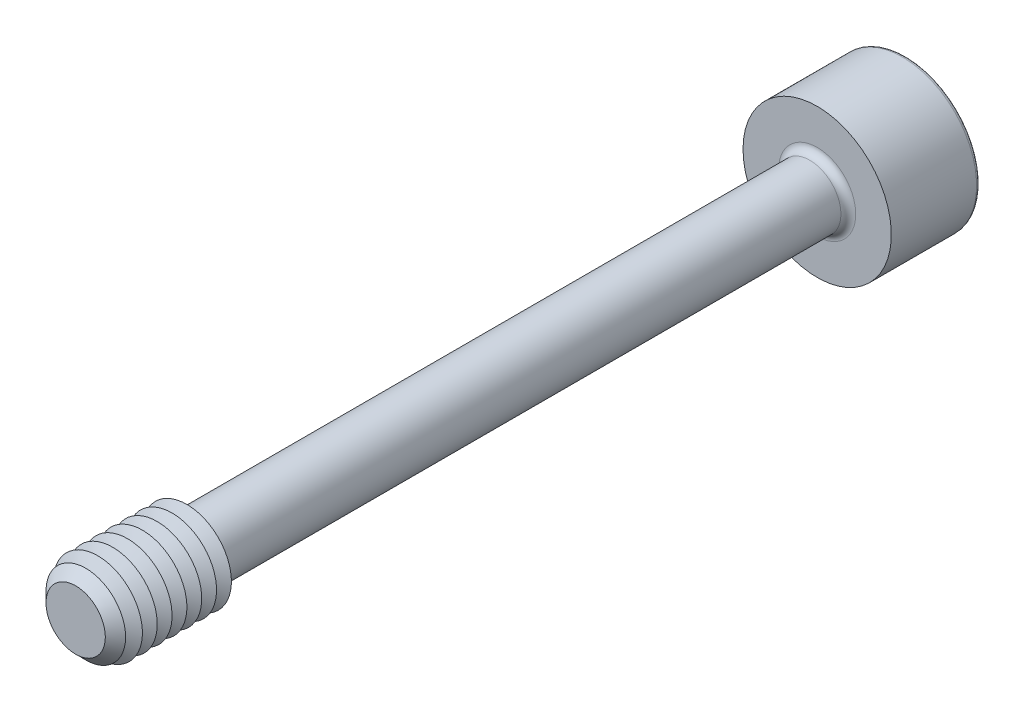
ISO-10303-21;
HEADER;
FILE_DESCRIPTION(('STEP AP214'),'2;1');
FILE_NAME('part.step','',(''),(''),'','','');
FILE_SCHEMA(('AUTOMOTIVE_DESIGN { 1 0 10303 214 1 1 1 1 }'));
ENDSEC;
DATA;
#1=APPLICATION_CONTEXT('core data for automotive mechanical design processes');
#2=APPLICATION_PROTOCOL_DEFINITION('international standard','automotive_design',2000,#1);
#3=PRODUCT_CONTEXT('',#1,'mechanical');
#4=PRODUCT('Part','Part','',(#3));
#5=PRODUCT_RELATED_PRODUCT_CATEGORY('part','',(#4));
#6=PRODUCT_DEFINITION_FORMATION('','',#4);
#7=PRODUCT_DEFINITION_CONTEXT('part definition',#1,'design');
#8=PRODUCT_DEFINITION('design','',#6,#7);
#9=PRODUCT_DEFINITION_SHAPE('','',#8);
#10=(LENGTH_UNIT() NAMED_UNIT(*) SI_UNIT(.MILLI.,.METRE.));
#11=(NAMED_UNIT(*) PLANE_ANGLE_UNIT() SI_UNIT($,.RADIAN.));
#12=(NAMED_UNIT(*) SI_UNIT($,.STERADIAN.) SOLID_ANGLE_UNIT());
#13=UNCERTAINTY_MEASURE_WITH_UNIT(LENGTH_MEASURE(1.E-05),#10,'distance_accuracy_value','');
#14=(GEOMETRIC_REPRESENTATION_CONTEXT(3) GLOBAL_UNCERTAINTY_ASSIGNED_CONTEXT((#13)) GLOBAL_UNIT_ASSIGNED_CONTEXT((#10,
#11,#12)) REPRESENTATION_CONTEXT('',''));
#15=CARTESIAN_POINT('',(0.,0.,0.));
#16=DIRECTION('',(0.,0.,1.));
#17=DIRECTION('',(1.,0.,0.));
#18=AXIS2_PLACEMENT_3D('',#15,#16,#17);
#19=CARTESIAN_POINT('',(-1.44337567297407,-2.5,-26.));
#20=DIRECTION('',(0.,0.,1.));
#21=DIRECTION('',(1.,0.,0.));
#22=AXIS2_PLACEMENT_3D('',#19,#20,#21);
#23=PLANE('',#22);
#24=DIRECTION('',(1.,0.,0.));
#25=VECTOR('',#24,1.);
#26=CARTESIAN_POINT('',(-1.44337567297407,-2.5,-26.));
#27=LINE('',#26,#25);
#28=CARTESIAN_POINT('',(0.,-2.5,-26.));
#29=VERTEX_POINT('',#28);
#30=CARTESIAN_POINT('',(1.44337567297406,-2.5,-26.));
#31=VERTEX_POINT('',#30);
#32=EDGE_CURVE('E728',#29,#31,#27,.T.);
#33=ORIENTED_EDGE('',*,*,#32,.F.);
#34=CARTESIAN_POINT('',(0.,0.,-26.));
#35=DIRECTION('',(0.,0.,1.));
#36=DIRECTION('',(0.,-1.,0.));
#37=AXIS2_PLACEMENT_3D('',#34,#35,#36);
#38=CIRCLE('',#37,2.5);
#39=CARTESIAN_POINT('',(2.1650635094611,-1.25,-26.));
#40=VERTEX_POINT('',#39);
#41=EDGE_CURVE('E53',#29,#40,#38,.T.);
#42=ORIENTED_EDGE('',*,*,#41,.T.);
#43=DIRECTION('',(0.5,0.866025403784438,0.));
#44=VECTOR('',#43,1.);
#45=CARTESIAN_POINT('',(1.44337567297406,-2.5,-26.));
#46=LINE('',#45,#44);
#47=EDGE_CURVE('E713',#31,#40,#46,.T.);
#48=ORIENTED_EDGE('',*,*,#47,.F.);
#49=EDGE_LOOP('',(#33,#42,#48));
#50=FACE_BOUND('',#49,.T.);
#51=ADVANCED_FACE('F41',(#50),#23,.F.);
#52=CARTESIAN_POINT('',(2.88675134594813,0.,-26.));
#53=VERTEX_POINT('',#52);
#54=EDGE_CURVE('E724',#40,#53,#46,.T.);
#55=ORIENTED_EDGE('',*,*,#54,.F.);
#56=CARTESIAN_POINT('',(2.1650635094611,1.25,-26.));
#57=VERTEX_POINT('',#56);
#58=EDGE_CURVE('E11',#40,#57,#38,.T.);
#59=ORIENTED_EDGE('',*,*,#58,.T.);
#60=DIRECTION('',(-0.5,0.866025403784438,0.));
#61=VECTOR('',#60,1.);
#62=CARTESIAN_POINT('',(2.88675134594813,0.,-26.));
#63=LINE('',#62,#61);
#64=EDGE_CURVE('E712',#53,#57,#63,.T.);
#65=ORIENTED_EDGE('',*,*,#64,.F.);
#66=EDGE_LOOP('',(#55,#59,#65));
#67=FACE_BOUND('',#66,.T.);
#68=ADVANCED_FACE('F133',(#67),#23,.F.);
#69=CARTESIAN_POINT('',(1.44337567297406,2.5,-26.));
#70=VERTEX_POINT('',#69);
#71=EDGE_CURVE('E707',#57,#70,#63,.T.);
#72=ORIENTED_EDGE('',*,*,#71,.F.);
#73=CARTESIAN_POINT('',(0.,2.5,-26.));
#74=VERTEX_POINT('',#73);
#75=EDGE_CURVE('E51',#57,#74,#38,.T.);
#76=ORIENTED_EDGE('',*,*,#75,.T.);
#77=DIRECTION('',(-1.,0.,0.));
#78=VECTOR('',#77,1.);
#79=CARTESIAN_POINT('',(1.44337567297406,2.5,-26.));
#80=LINE('',#79,#78);
#81=EDGE_CURVE('E177',#70,#74,#80,.T.);
#82=ORIENTED_EDGE('',*,*,#81,.F.);
#83=EDGE_LOOP('',(#72,#76,#82));
#84=FACE_BOUND('',#83,.T.);
#85=ADVANCED_FACE('F139',(#84),#23,.F.);
#86=CARTESIAN_POINT('',(-1.44337567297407,2.5,-26.));
#87=VERTEX_POINT('',#86);
#88=EDGE_CURVE('E718',#74,#87,#80,.T.);
#89=ORIENTED_EDGE('',*,*,#88,.F.);
#90=CARTESIAN_POINT('',(-2.1650635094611,1.25,-26.));
#91=VERTEX_POINT('',#90);
#92=EDGE_CURVE('E264',#74,#91,#38,.T.);
#93=ORIENTED_EDGE('',*,*,#92,.T.);
#94=DIRECTION('',(-0.5,-0.866025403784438,0.));
#95=VECTOR('',#94,1.);
#96=CARTESIAN_POINT('',(-1.44337567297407,2.5,-26.));
#97=LINE('',#96,#95);
#98=EDGE_CURVE('E176',#87,#91,#97,.T.);
#99=ORIENTED_EDGE('',*,*,#98,.F.);
#100=EDGE_LOOP('',(#89,#93,#99));
#101=FACE_BOUND('',#100,.T.);
#102=ADVANCED_FACE('F157',(#101),#23,.F.);
#103=CARTESIAN_POINT('',(-2.88675134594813,0.,-26.));
#104=VERTEX_POINT('',#103);
#105=EDGE_CURVE('E170',#91,#104,#97,.T.);
#106=ORIENTED_EDGE('',*,*,#105,.F.);
#107=CARTESIAN_POINT('',(-2.1650635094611,-1.25,-26.));
#108=VERTEX_POINT('',#107);
#109=EDGE_CURVE('E172',#91,#108,#38,.T.);
#110=ORIENTED_EDGE('',*,*,#109,.T.);
#111=DIRECTION('',(0.5,-0.866025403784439,0.));
#112=VECTOR('',#111,1.);
#113=CARTESIAN_POINT('',(-2.88675134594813,0.,-26.));
#114=LINE('',#113,#112);
#115=EDGE_CURVE('E174',#104,#108,#114,.T.);
#116=ORIENTED_EDGE('',*,*,#115,.F.);
#117=EDGE_LOOP('',(#106,#110,#116));
#118=FACE_BOUND('',#117,.T.);
#119=ADVANCED_FACE('F146',(#118),#23,.F.);
#120=CARTESIAN_POINT('',(0.,0.,-31.));
#121=DIRECTION('',(0.,0.,-1.));
#122=DIRECTION('',(-1.,0.,0.));
#123=AXIS2_PLACEMENT_3D('',#120,#121,#122);
#124=PLANE('',#123);
#125=CARTESIAN_POINT('',(0.,0.,-31.));
#126=DIRECTION('',(0.,0.,-1.));
#127=DIRECTION('',(-1.,0.,0.));
#128=AXIS2_PLACEMENT_3D('',#125,#126,#127);
#129=CIRCLE('',#128,4.75);
#130=CARTESIAN_POINT('',(-4.75,0.,-31.));
#131=VERTEX_POINT('',#130);
#132=EDGE_CURVE('E250',#131,#131,#129,.T.);
#133=ORIENTED_EDGE('',*,*,#132,.T.);
#134=EDGE_LOOP('',(#133));
#135=FACE_BOUND('',#134,.T.);
#136=DIRECTION('',(-0.5,-0.866025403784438,0.));
#137=VECTOR('',#136,1.);
#138=CARTESIAN_POINT('',(-1.44337567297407,2.5,-31.));
#139=LINE('',#138,#137);
#140=CARTESIAN_POINT('',(-1.44337567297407,2.5,-31.));
#141=VERTEX_POINT('',#140);
#142=CARTESIAN_POINT('',(-2.88675134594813,0.,-31.));
#143=VERTEX_POINT('',#142);
#144=EDGE_CURVE('E212',#141,#143,#139,.T.);
#145=ORIENTED_EDGE('',*,*,#144,.T.);
#146=DIRECTION('',(0.5,-0.866025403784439,0.));
#147=VECTOR('',#146,1.);
#148=CARTESIAN_POINT('',(-2.88675134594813,0.,-31.));
#149=LINE('',#148,#147);
#150=CARTESIAN_POINT('',(-1.44337567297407,-2.5,-31.));
#151=VERTEX_POINT('',#150);
#152=EDGE_CURVE('E67',#143,#151,#149,.T.);
#153=ORIENTED_EDGE('',*,*,#152,.T.);
#154=DIRECTION('',(1.,0.,0.));
#155=VECTOR('',#154,1.);
#156=CARTESIAN_POINT('',(-1.44337567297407,-2.5,-31.));
#157=LINE('',#156,#155);
#158=CARTESIAN_POINT('',(1.44337567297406,-2.5,-31.));
#159=VERTEX_POINT('',#158);
#160=EDGE_CURVE('E196',#151,#159,#157,.T.);
#161=ORIENTED_EDGE('',*,*,#160,.T.);
#162=DIRECTION('',(0.5,0.866025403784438,0.));
#163=VECTOR('',#162,1.);
#164=CARTESIAN_POINT('',(1.44337567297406,-2.5,-31.));
#165=LINE('',#164,#163);
#166=CARTESIAN_POINT('',(2.88675134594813,0.,-31.));
#167=VERTEX_POINT('',#166);
#168=EDGE_CURVE('E200',#159,#167,#165,.T.);
#169=ORIENTED_EDGE('',*,*,#168,.T.);
#170=DIRECTION('',(-0.5,0.866025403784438,0.));
#171=VECTOR('',#170,1.);
#172=CARTESIAN_POINT('',(2.88675134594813,0.,-31.));
#173=LINE('',#172,#171);
#174=CARTESIAN_POINT('',(1.44337567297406,2.5,-31.));
#175=VERTEX_POINT('',#174);
#176=EDGE_CURVE('E204',#167,#175,#173,.T.);
#177=ORIENTED_EDGE('',*,*,#176,.T.);
#178=DIRECTION('',(-1.,0.,0.));
#179=VECTOR('',#178,1.);
#180=CARTESIAN_POINT('',(1.44337567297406,2.5,-31.));
#181=LINE('',#180,#179);
#182=EDGE_CURVE('E208',#175,#141,#181,.T.);
#183=ORIENTED_EDGE('',*,*,#182,.T.);
#184=EDGE_LOOP('',(#145,#153,#161,#169,#177,#183));
#185=FACE_BOUND('',#184,.T.);
#186=ADVANCED_FACE('F156',(#135,#185),#124,.T.);
#187=CARTESIAN_POINT('',(0.,0.,25.));
#188=DIRECTION('',(0.,0.,-1.));
#189=DIRECTION('',(-1.,0.,0.));
#190=AXIS2_PLACEMENT_3D('',#187,#188,#189);
#191=CYLINDRICAL_SURFACE('',#190,2.1);
#192=CARTESIAN_POINT('',(0.,0.,-24.5));
#193=DIRECTION('',(0.,0.,-1.));
#194=DIRECTION('',(-1.,0.,0.));
#195=AXIS2_PLACEMENT_3D('',#192,#193,#194);
#196=CIRCLE('',#195,2.1);
#197=CARTESIAN_POINT('',(-2.1,0.,-24.5));
#198=VERTEX_POINT('',#197);
#199=EDGE_CURVE('E246',#198,#198,#196,.F.);
#200=ORIENTED_EDGE('',*,*,#199,.T.);
#201=EDGE_LOOP('',(#200));
#202=FACE_BOUND('',#201,.T.);
#203=CARTESIAN_POINT('',(0.,0.,16.9803847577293));
#204=DIRECTION('',(0.,0.,-1.));
#205=DIRECTION('',(0.,1.,0.));
#206=AXIS2_PLACEMENT_3D('',#203,#204,#205);
#207=CIRCLE('',#206,2.1);
#208=CARTESIAN_POINT('',(0.,2.1,16.9803847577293));
#209=VERTEX_POINT('',#208);
#210=EDGE_CURVE('E234',#209,#209,#207,.T.);
#211=ORIENTED_EDGE('',*,*,#210,.T.);
#212=EDGE_LOOP('',(#211));
#213=FACE_BOUND('',#212,.T.);
#214=ADVANCED_FACE('F163',(#202,#213),#191,.T.);
#215=CARTESIAN_POINT('',(0.,0.,16.9803847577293));
#216=DIRECTION('',(0.,0.,1.));
#217=DIRECTION('',(0.,-1.,0.));
#218=AXIS2_PLACEMENT_3D('',#215,#216,#217);
#219=CONICAL_SURFACE('',#218,2.1,1.0471975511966);
#220=CARTESIAN_POINT('',(0.,0.,17.5));
#221=DIRECTION('',(0.,0.,-1.));
#222=DIRECTION('',(-1.,0.,0.));
#223=AXIS2_PLACEMENT_3D('',#220,#221,#222);
#224=CIRCLE('',#223,3.);
#225=CARTESIAN_POINT('',(-3.,0.,17.5));
#226=VERTEX_POINT('',#225);
#227=EDGE_CURVE('E268',#226,#226,#224,.T.);
#228=ORIENTED_EDGE('',*,*,#227,.T.);
#229=EDGE_LOOP('',(#228));
#230=FACE_BOUND('',#229,.T.);
#231=ORIENTED_EDGE('',*,*,#210,.F.);
#232=EDGE_LOOP('',(#231));
#233=FACE_BOUND('',#232,.T.);
#234=ADVANCED_FACE('F484',(#230,#233),#219,.T.);
#235=CARTESIAN_POINT('',(0.,0.,-25.));
#236=DIRECTION('',(0.,0.,-1.));
#237=DIRECTION('',(-1.,0.,0.));
#238=AXIS2_PLACEMENT_3D('',#235,#236,#237);
#239=PLANE('',#238);
#240=CARTESIAN_POINT('',(0.,0.,-25.));
#241=DIRECTION('',(0.,0.,-1.));
#242=DIRECTION('',(-1.,0.,0.));
#243=AXIS2_PLACEMENT_3D('',#240,#241,#242);
#244=CIRCLE('',#243,2.6);
#245=CARTESIAN_POINT('',(-2.6,0.,-25.));
#246=VERTEX_POINT('',#245);
#247=EDGE_CURVE('E242',#246,#246,#244,.T.);
#248=ORIENTED_EDGE('',*,*,#247,.T.);
#249=EDGE_LOOP('',(#248));
#250=FACE_BOUND('',#249,.T.);
#251=CARTESIAN_POINT('',(0.,0.,-25.));
#252=DIRECTION('',(0.,0.,-1.));
#253=DIRECTION('',(-1.,0.,0.));
#254=AXIS2_PLACEMENT_3D('',#251,#252,#253);
#255=CIRCLE('',#254,5.);
#256=CARTESIAN_POINT('',(-5.,0.,-25.));
#257=VERTEX_POINT('',#256);
#258=EDGE_CURVE('E230',#257,#257,#255,.T.);
#259=ORIENTED_EDGE('',*,*,#258,.F.);
#260=EDGE_LOOP('',(#259));
#261=FACE_BOUND('',#260,.T.);
#262=ADVANCED_FACE('F477',(#250,#261),#239,.F.);
#263=CARTESIAN_POINT('',(0.,0.,-31.));
#264=DIRECTION('',(0.,0.,1.));
#265=DIRECTION('',(1.,0.,0.));
#266=AXIS2_PLACEMENT_3D('',#263,#264,#265);
#267=CYLINDRICAL_SURFACE('',#266,5.);
#268=CARTESIAN_POINT('',(0.,0.,-30.75));
#269=DIRECTION('',(0.,0.,-1.));
#270=DIRECTION('',(-1.,0.,0.));
#271=AXIS2_PLACEMENT_3D('',#268,#269,#270);
#272=CIRCLE('',#271,5.);
#273=CARTESIAN_POINT('',(-5.,0.,-30.75));
#274=VERTEX_POINT('',#273);
#275=EDGE_CURVE('E253',#274,#274,#272,.F.);
#276=ORIENTED_EDGE('',*,*,#275,.T.);
#277=EDGE_LOOP('',(#276));
#278=FACE_BOUND('',#277,.T.);
#279=ORIENTED_EDGE('',*,*,#258,.T.);
#280=EDGE_LOOP('',(#279));
#281=FACE_BOUND('',#280,.T.);
#282=ADVANCED_FACE('F483',(#278,#281),#267,.T.);
#283=CARTESIAN_POINT('',(-2.88675134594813,0.,-26.));
#284=DIRECTION('',(0.866025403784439,0.5,0.));
#285=DIRECTION('',(-0.5,0.866025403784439,0.));
#286=AXIS2_PLACEMENT_3D('',#283,#284,#285);
#287=PLANE('',#286);
#288=ORIENTED_EDGE('',*,*,#152,.F.);
#289=DIRECTION('',(0.,0.,-1.));
#290=VECTOR('',#289,1.);
#291=CARTESIAN_POINT('',(-2.88675134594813,0.,-26.));
#292=LINE('',#291,#290);
#293=EDGE_CURVE('E186',#104,#143,#292,.T.);
#294=ORIENTED_EDGE('',*,*,#293,.F.);
#295=ORIENTED_EDGE('',*,*,#115,.T.);
#296=CARTESIAN_POINT('',(-1.44337567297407,-2.5,-26.));
#297=VERTEX_POINT('',#296);
#298=EDGE_CURVE('E215',#108,#297,#114,.T.);
#299=ORIENTED_EDGE('',*,*,#298,.T.);
#300=DIRECTION('',(0.,0.,-1.));
#301=VECTOR('',#300,1.);
#302=CARTESIAN_POINT('',(-1.44337567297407,-2.5,-26.));
#303=LINE('',#302,#301);
#304=EDGE_CURVE('E227',#297,#151,#303,.T.);
#305=ORIENTED_EDGE('',*,*,#304,.T.);
#306=EDGE_LOOP('',(#288,#294,#295,#299,#305));
#307=FACE_BOUND('',#306,.T.);
#308=ADVANCED_FACE('F495',(#307),#287,.T.);
#309=CARTESIAN_POINT('',(-1.44337567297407,-2.5,-26.));
#310=DIRECTION('',(0.,1.,0.));
#311=DIRECTION('',(-1.,0.,0.));
#312=AXIS2_PLACEMENT_3D('',#309,#310,#311);
#313=PLANE('',#312);
#314=ORIENTED_EDGE('',*,*,#160,.F.);
#315=ORIENTED_EDGE('',*,*,#304,.F.);
#316=EDGE_CURVE('E725',#297,#29,#27,.T.);
#317=ORIENTED_EDGE('',*,*,#316,.T.);
#318=ORIENTED_EDGE('',*,*,#32,.T.);
#319=DIRECTION('',(0.,0.,-1.));
#320=VECTOR('',#319,1.);
#321=CARTESIAN_POINT('',(1.44337567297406,-2.5,-26.));
#322=LINE('',#321,#320);
#323=EDGE_CURVE('E225',#31,#159,#322,.T.);
#324=ORIENTED_EDGE('',*,*,#323,.T.);
#325=EDGE_LOOP('',(#314,#315,#317,#318,#324));
#326=FACE_BOUND('',#325,.T.);
#327=ADVANCED_FACE('F511',(#326),#313,.T.);
#328=CARTESIAN_POINT('',(1.44337567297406,-2.5,-26.));
#329=DIRECTION('',(-0.866025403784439,0.5,0.));
#330=DIRECTION('',(-0.5,-0.866025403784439,0.));
#331=AXIS2_PLACEMENT_3D('',#328,#329,#330);
#332=PLANE('',#331);
#333=ORIENTED_EDGE('',*,*,#168,.F.);
#334=ORIENTED_EDGE('',*,*,#323,.F.);
#335=ORIENTED_EDGE('',*,*,#47,.T.);
#336=ORIENTED_EDGE('',*,*,#54,.T.);
#337=DIRECTION('',(0.,0.,-1.));
#338=VECTOR('',#337,1.);
#339=CARTESIAN_POINT('',(2.88675134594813,0.,-26.));
#340=LINE('',#339,#338);
#341=EDGE_CURVE('E222',#53,#167,#340,.T.);
#342=ORIENTED_EDGE('',*,*,#341,.T.);
#343=EDGE_LOOP('',(#333,#334,#335,#336,#342));
#344=FACE_BOUND('',#343,.T.);
#345=ADVANCED_FACE('F521',(#344),#332,.T.);
#346=CARTESIAN_POINT('',(2.88675134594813,0.,-26.));
#347=DIRECTION('',(-0.866025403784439,-0.5,0.));
#348=DIRECTION('',(0.5,-0.866025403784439,0.));
#349=AXIS2_PLACEMENT_3D('',#346,#347,#348);
#350=PLANE('',#349);
#351=ORIENTED_EDGE('',*,*,#176,.F.);
#352=ORIENTED_EDGE('',*,*,#341,.F.);
#353=ORIENTED_EDGE('',*,*,#64,.T.);
#354=ORIENTED_EDGE('',*,*,#71,.T.);
#355=DIRECTION('',(0.,0.,-1.));
#356=VECTOR('',#355,1.);
#357=CARTESIAN_POINT('',(1.44337567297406,2.5,-26.));
#358=LINE('',#357,#356);
#359=EDGE_CURVE('E219',#70,#175,#358,.T.);
#360=ORIENTED_EDGE('',*,*,#359,.T.);
#361=EDGE_LOOP('',(#351,#352,#353,#354,#360));
#362=FACE_BOUND('',#361,.T.);
#363=ADVANCED_FACE('F531',(#362),#350,.T.);
#364=CARTESIAN_POINT('',(1.44337567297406,2.5,-26.));
#365=DIRECTION('',(0.,-1.,0.));
#366=DIRECTION('',(0.,0.,-1.));
#367=AXIS2_PLACEMENT_3D('',#364,#365,#366);
#368=PLANE('',#367);
#369=ORIENTED_EDGE('',*,*,#182,.F.);
#370=ORIENTED_EDGE('',*,*,#359,.F.);
#371=ORIENTED_EDGE('',*,*,#81,.T.);
#372=ORIENTED_EDGE('',*,*,#88,.T.);
#373=DIRECTION('',(0.,0.,-1.));
#374=VECTOR('',#373,1.);
#375=CARTESIAN_POINT('',(-1.44337567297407,2.5,-26.));
#376=LINE('',#375,#374);
#377=EDGE_CURVE('E182',#87,#141,#376,.T.);
#378=ORIENTED_EDGE('',*,*,#377,.T.);
#379=EDGE_LOOP('',(#369,#370,#371,#372,#378));
#380=FACE_BOUND('',#379,.T.);
#381=ADVANCED_FACE('F152',(#380),#368,.T.);
#382=CARTESIAN_POINT('',(-1.44337567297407,2.5,-26.));
#383=DIRECTION('',(0.866025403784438,-0.5,0.));
#384=DIRECTION('',(0.5,0.866025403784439,0.));
#385=AXIS2_PLACEMENT_3D('',#382,#383,#384);
#386=PLANE('',#385);
#387=ORIENTED_EDGE('',*,*,#144,.F.);
#388=ORIENTED_EDGE('',*,*,#377,.F.);
#389=ORIENTED_EDGE('',*,*,#98,.T.);
#390=ORIENTED_EDGE('',*,*,#105,.T.);
#391=ORIENTED_EDGE('',*,*,#293,.T.);
#392=EDGE_LOOP('',(#387,#388,#389,#390,#391));
#393=FACE_BOUND('',#392,.T.);
#394=ADVANCED_FACE('F144',(#393),#386,.T.);
#395=ORIENTED_EDGE('',*,*,#298,.F.);
#396=EDGE_CURVE('E256',#108,#29,#38,.T.);
#397=ORIENTED_EDGE('',*,*,#396,.T.);
#398=ORIENTED_EDGE('',*,*,#316,.F.);
#399=EDGE_LOOP('',(#395,#397,#398));
#400=FACE_BOUND('',#399,.T.);
#401=ADVANCED_FACE('F135',(#400),#23,.F.);
#402=CARTESIAN_POINT('',(0.,0.,-24.5));
#403=DIRECTION('',(0.,0.,-1.));
#404=DIRECTION('',(-1.,0.,0.));
#405=AXIS2_PLACEMENT_3D('',#402,#403,#404);
#406=TOROIDAL_SURFACE('',#405,2.6,0.5);
#407=ORIENTED_EDGE('',*,*,#199,.F.);
#408=EDGE_LOOP('',(#407));
#409=FACE_BOUND('',#408,.T.);
#410=ORIENTED_EDGE('',*,*,#247,.F.);
#411=EDGE_LOOP('',(#410));
#412=FACE_BOUND('',#411,.T.);
#413=ADVANCED_FACE('F129',(#409,#412),#406,.F.);
#414=CARTESIAN_POINT('',(0.,0.,-30.75));
#415=DIRECTION('',(0.,0.,-1.));
#416=DIRECTION('',(-1.,0.,0.));
#417=AXIS2_PLACEMENT_3D('',#414,#415,#416);
#418=TOROIDAL_SURFACE('',#417,4.75,0.25);
#419=ORIENTED_EDGE('',*,*,#275,.F.);
#420=EDGE_LOOP('',(#419));
#421=FACE_BOUND('',#420,.T.);
#422=ORIENTED_EDGE('',*,*,#132,.F.);
#423=EDGE_LOOP('',(#422));
#424=FACE_BOUND('',#423,.T.);
#425=ADVANCED_FACE('F43',(#421,#424),#418,.T.);
#426=CARTESIAN_POINT('',(0.,0.,-24.556624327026));
#427=DIRECTION('',(0.,0.,-1.));
#428=DIRECTION('',(0.,1.,0.));
#429=AXIS2_PLACEMENT_3D('',#426,#427,#428);
#430=CONICAL_SURFACE('',#429,0.,1.0471975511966);
#431=ORIENTED_EDGE('',*,*,#41,.F.);
#432=ORIENTED_EDGE('',*,*,#396,.F.);
#433=ORIENTED_EDGE('',*,*,#109,.F.);
#434=ORIENTED_EDGE('',*,*,#92,.F.);
#435=ORIENTED_EDGE('',*,*,#75,.F.);
#436=ORIENTED_EDGE('',*,*,#58,.F.);
#437=EDGE_LOOP('',(#431,#432,#433,#434,#435,#436));
#438=FACE_BOUND('',#437,.T.);
#439=CARTESIAN_POINT('',(0.,0.,-24.556624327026));
#440=VERTEX_POINT('',#439);
#441=VERTEX_LOOP('',#440);
#442=FACE_BOUND('',#441,.T.);
#443=ADVANCED_FACE('F118',(#438,#442),#430,.F.);
#444=CARTESIAN_POINT('',(0.,0.,18.));
#445=DIRECTION('',(0.,0.,-1.));
#446=DIRECTION('',(-1.,0.,0.));
#447=AXIS2_PLACEMENT_3D('',#444,#445,#446);
#448=CONICAL_SURFACE('',#447,2.13397459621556,1.0471975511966);
#449=ORIENTED_EDGE('',*,*,#227,.F.);
#450=EDGE_LOOP('',(#449));
#451=FACE_BOUND('',#450,.T.);
#452=CARTESIAN_POINT('',(0.,0.,18.));
#453=DIRECTION('',(0.,0.,-1.));
#454=DIRECTION('',(-1.,0.,0.));
#455=AXIS2_PLACEMENT_3D('',#452,#453,#454);
#456=CIRCLE('',#455,2.13397459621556);
#457=CARTESIAN_POINT('',(-2.13397459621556,0.,18.));
#458=VERTEX_POINT('',#457);
#459=EDGE_CURVE('E275',#458,#458,#456,.T.);
#460=ORIENTED_EDGE('',*,*,#459,.T.);
#461=EDGE_LOOP('',(#460));
#462=FACE_BOUND('',#461,.T.);
#463=ADVANCED_FACE('F120',(#451,#462),#448,.T.);
#464=CARTESIAN_POINT('',(0.,0.,18.5));
#465=DIRECTION('',(0.,0.,1.));
#466=DIRECTION('',(1.,0.,0.));
#467=AXIS2_PLACEMENT_3D('',#464,#465,#466);
#468=CONICAL_SURFACE('',#467,3.,1.0471975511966);
#469=ORIENTED_EDGE('',*,*,#459,.F.);
#470=EDGE_LOOP('',(#469));
#471=FACE_BOUND('',#470,.T.);
#472=CARTESIAN_POINT('',(0.,0.,18.5));
#473=DIRECTION('',(0.,0.,-1.));
#474=DIRECTION('',(-1.,0.,0.));
#475=AXIS2_PLACEMENT_3D('',#472,#473,#474);
#476=CIRCLE('',#475,3.);
#477=CARTESIAN_POINT('',(-3.,0.,18.5));
#478=VERTEX_POINT('',#477);
#479=EDGE_CURVE('E281',#478,#478,#476,.T.);
#480=ORIENTED_EDGE('',*,*,#479,.T.);
#481=EDGE_LOOP('',(#480));
#482=FACE_BOUND('',#481,.T.);
#483=ADVANCED_FACE('F126',(#471,#482),#468,.T.);
#484=CARTESIAN_POINT('',(0.,0.,19.));
#485=DIRECTION('',(0.,0.,-1.));
#486=DIRECTION('',(-1.,0.,0.));
#487=AXIS2_PLACEMENT_3D('',#484,#485,#486);
#488=CONICAL_SURFACE('',#487,2.13397459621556,1.0471975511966);
#489=ORIENTED_EDGE('',*,*,#479,.F.);
#490=EDGE_LOOP('',(#489));
#491=FACE_BOUND('',#490,.T.);
#492=CARTESIAN_POINT('',(0.,0.,19.));
#493=DIRECTION('',(0.,0.,-1.));
#494=DIRECTION('',(-1.,0.,0.));
#495=AXIS2_PLACEMENT_3D('',#492,#493,#494);
#496=CIRCLE('',#495,2.13397459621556);
#497=CARTESIAN_POINT('',(-2.13397459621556,0.,19.));
#498=VERTEX_POINT('',#497);
#499=EDGE_CURVE('E287',#498,#498,#496,.T.);
#500=ORIENTED_EDGE('',*,*,#499,.T.);
#501=EDGE_LOOP('',(#500));
#502=FACE_BOUND('',#501,.T.);
#503=ADVANCED_FACE('F381',(#491,#502),#488,.T.);
#504=CARTESIAN_POINT('',(0.,0.,19.5));
#505=DIRECTION('',(0.,0.,1.));
#506=DIRECTION('',(1.,0.,0.));
#507=AXIS2_PLACEMENT_3D('',#504,#505,#506);
#508=CONICAL_SURFACE('',#507,3.,1.0471975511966);
#509=ORIENTED_EDGE('',*,*,#499,.F.);
#510=EDGE_LOOP('',(#509));
#511=FACE_BOUND('',#510,.T.);
#512=CARTESIAN_POINT('',(0.,0.,19.5));
#513=DIRECTION('',(0.,0.,-1.));
#514=DIRECTION('',(-1.,0.,0.));
#515=AXIS2_PLACEMENT_3D('',#512,#513,#514);
#516=CIRCLE('',#515,3.);
#517=CARTESIAN_POINT('',(-3.,0.,19.5));
#518=VERTEX_POINT('',#517);
#519=EDGE_CURVE('E291',#518,#518,#516,.T.);
#520=ORIENTED_EDGE('',*,*,#519,.T.);
#521=EDGE_LOOP('',(#520));
#522=FACE_BOUND('',#521,.T.);
#523=ADVANCED_FACE('F377',(#511,#522),#508,.T.);
#524=CARTESIAN_POINT('',(0.,0.,20.));
#525=DIRECTION('',(0.,0.,-1.));
#526=DIRECTION('',(-1.,0.,0.));
#527=AXIS2_PLACEMENT_3D('',#524,#525,#526);
#528=CONICAL_SURFACE('',#527,2.13397459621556,1.0471975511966);
#529=ORIENTED_EDGE('',*,*,#519,.F.);
#530=EDGE_LOOP('',(#529));
#531=FACE_BOUND('',#530,.T.);
#532=CARTESIAN_POINT('',(0.,0.,20.));
#533=DIRECTION('',(0.,0.,-1.));
#534=DIRECTION('',(-1.,0.,0.));
#535=AXIS2_PLACEMENT_3D('',#532,#533,#534);
#536=CIRCLE('',#535,2.13397459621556);
#537=CARTESIAN_POINT('',(-2.13397459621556,0.,20.));
#538=VERTEX_POINT('',#537);
#539=EDGE_CURVE('E294',#538,#538,#536,.T.);
#540=ORIENTED_EDGE('',*,*,#539,.T.);
#541=EDGE_LOOP('',(#540));
#542=FACE_BOUND('',#541,.T.);
#543=ADVANCED_FACE('F373',(#531,#542),#528,.T.);
#544=CARTESIAN_POINT('',(0.,0.,20.5));
#545=DIRECTION('',(0.,0.,1.));
#546=DIRECTION('',(1.,0.,0.));
#547=AXIS2_PLACEMENT_3D('',#544,#545,#546);
#548=CONICAL_SURFACE('',#547,3.,1.0471975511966);
#549=ORIENTED_EDGE('',*,*,#539,.F.);
#550=EDGE_LOOP('',(#549));
#551=FACE_BOUND('',#550,.T.);
#552=CARTESIAN_POINT('',(0.,0.,20.5));
#553=DIRECTION('',(0.,0.,-1.));
#554=DIRECTION('',(-1.,0.,0.));
#555=AXIS2_PLACEMENT_3D('',#552,#553,#554);
#556=CIRCLE('',#555,3.);
#557=CARTESIAN_POINT('',(-3.,0.,20.5));
#558=VERTEX_POINT('',#557);
#559=EDGE_CURVE('E298',#558,#558,#556,.T.);
#560=ORIENTED_EDGE('',*,*,#559,.T.);
#561=EDGE_LOOP('',(#560));
#562=FACE_BOUND('',#561,.T.);
#563=ADVANCED_FACE('F369',(#551,#562),#548,.T.);
#564=CARTESIAN_POINT('',(0.,0.,21.));
#565=DIRECTION('',(0.,0.,-1.));
#566=DIRECTION('',(-1.,0.,0.));
#567=AXIS2_PLACEMENT_3D('',#564,#565,#566);
#568=CONICAL_SURFACE('',#567,2.13397459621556,1.0471975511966);
#569=ORIENTED_EDGE('',*,*,#559,.F.);
#570=EDGE_LOOP('',(#569));
#571=FACE_BOUND('',#570,.T.);
#572=CARTESIAN_POINT('',(0.,0.,21.));
#573=DIRECTION('',(0.,0.,-1.));
#574=DIRECTION('',(-1.,0.,0.));
#575=AXIS2_PLACEMENT_3D('',#572,#573,#574);
#576=CIRCLE('',#575,2.13397459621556);
#577=CARTESIAN_POINT('',(-2.13397459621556,0.,21.));
#578=VERTEX_POINT('',#577);
#579=EDGE_CURVE('E302',#578,#578,#576,.T.);
#580=ORIENTED_EDGE('',*,*,#579,.T.);
#581=EDGE_LOOP('',(#580));
#582=FACE_BOUND('',#581,.T.);
#583=ADVANCED_FACE('F365',(#571,#582),#568,.T.);
#584=CARTESIAN_POINT('',(0.,0.,21.5));
#585=DIRECTION('',(0.,0.,1.));
#586=DIRECTION('',(1.,0.,0.));
#587=AXIS2_PLACEMENT_3D('',#584,#585,#586);
#588=CONICAL_SURFACE('',#587,3.,1.0471975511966);
#589=ORIENTED_EDGE('',*,*,#579,.F.);
#590=EDGE_LOOP('',(#589));
#591=FACE_BOUND('',#590,.T.);
#592=CARTESIAN_POINT('',(0.,0.,21.5));
#593=DIRECTION('',(0.,0.,-1.));
#594=DIRECTION('',(-1.,0.,0.));
#595=AXIS2_PLACEMENT_3D('',#592,#593,#594);
#596=CIRCLE('',#595,3.);
#597=CARTESIAN_POINT('',(-3.,0.,21.5));
#598=VERTEX_POINT('',#597);
#599=EDGE_CURVE('E306',#598,#598,#596,.T.);
#600=ORIENTED_EDGE('',*,*,#599,.T.);
#601=EDGE_LOOP('',(#600));
#602=FACE_BOUND('',#601,.T.);
#603=ADVANCED_FACE('F361',(#591,#602),#588,.T.);
#604=CARTESIAN_POINT('',(0.,0.,22.));
#605=DIRECTION('',(0.,0.,-1.));
#606=DIRECTION('',(-1.,0.,0.));
#607=AXIS2_PLACEMENT_3D('',#604,#605,#606);
#608=CONICAL_SURFACE('',#607,2.13397459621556,1.0471975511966);
#609=ORIENTED_EDGE('',*,*,#599,.F.);
#610=EDGE_LOOP('',(#609));
#611=FACE_BOUND('',#610,.T.);
#612=CARTESIAN_POINT('',(0.,0.,22.));
#613=DIRECTION('',(0.,0.,-1.));
#614=DIRECTION('',(-1.,0.,0.));
#615=AXIS2_PLACEMENT_3D('',#612,#613,#614);
#616=CIRCLE('',#615,2.13397459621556);
#617=CARTESIAN_POINT('',(-2.13397459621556,0.,22.));
#618=VERTEX_POINT('',#617);
#619=EDGE_CURVE('E309',#618,#618,#616,.T.);
#620=ORIENTED_EDGE('',*,*,#619,.T.);
#621=EDGE_LOOP('',(#620));
#622=FACE_BOUND('',#621,.T.);
#623=ADVANCED_FACE('F357',(#611,#622),#608,.T.);
#624=CARTESIAN_POINT('',(0.,0.,22.5));
#625=DIRECTION('',(0.,0.,1.));
#626=DIRECTION('',(1.,0.,0.));
#627=AXIS2_PLACEMENT_3D('',#624,#625,#626);
#628=CONICAL_SURFACE('',#627,3.,1.0471975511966);
#629=ORIENTED_EDGE('',*,*,#619,.F.);
#630=EDGE_LOOP('',(#629));
#631=FACE_BOUND('',#630,.T.);
#632=CARTESIAN_POINT('',(0.,0.,22.5));
#633=DIRECTION('',(0.,0.,-1.));
#634=DIRECTION('',(-1.,0.,0.));
#635=AXIS2_PLACEMENT_3D('',#632,#633,#634);
#636=CIRCLE('',#635,3.);
#637=CARTESIAN_POINT('',(-3.,0.,22.5));
#638=VERTEX_POINT('',#637);
#639=EDGE_CURVE('E313',#638,#638,#636,.T.);
#640=ORIENTED_EDGE('',*,*,#639,.T.);
#641=EDGE_LOOP('',(#640));
#642=FACE_BOUND('',#641,.T.);
#643=ADVANCED_FACE('F353',(#631,#642),#628,.T.);
#644=CARTESIAN_POINT('',(0.,0.,23.));
#645=DIRECTION('',(0.,0.,-1.));
#646=DIRECTION('',(-1.,0.,0.));
#647=AXIS2_PLACEMENT_3D('',#644,#645,#646);
#648=CONICAL_SURFACE('',#647,2.13397459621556,1.0471975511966);
#649=ORIENTED_EDGE('',*,*,#639,.F.);
#650=EDGE_LOOP('',(#649));
#651=FACE_BOUND('',#650,.T.);
#652=CARTESIAN_POINT('',(0.,0.,23.));
#653=DIRECTION('',(0.,0.,-1.));
#654=DIRECTION('',(-1.,0.,0.));
#655=AXIS2_PLACEMENT_3D('',#652,#653,#654);
#656=CIRCLE('',#655,2.13397459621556);
#657=CARTESIAN_POINT('',(-2.13397459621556,0.,23.));
#658=VERTEX_POINT('',#657);
#659=EDGE_CURVE('E317',#658,#658,#656,.T.);
#660=ORIENTED_EDGE('',*,*,#659,.T.);
#661=EDGE_LOOP('',(#660));
#662=FACE_BOUND('',#661,.T.);
#663=ADVANCED_FACE('F349',(#651,#662),#648,.T.);
#664=CARTESIAN_POINT('',(0.,0.,23.5));
#665=DIRECTION('',(0.,0.,1.));
#666=DIRECTION('',(1.,0.,0.));
#667=AXIS2_PLACEMENT_3D('',#664,#665,#666);
#668=CONICAL_SURFACE('',#667,3.,1.0471975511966);
#669=ORIENTED_EDGE('',*,*,#659,.F.);
#670=EDGE_LOOP('',(#669));
#671=FACE_BOUND('',#670,.T.);
#672=CARTESIAN_POINT('',(0.,0.,23.5));
#673=DIRECTION('',(0.,0.,-1.));
#674=DIRECTION('',(-1.,0.,0.));
#675=AXIS2_PLACEMENT_3D('',#672,#673,#674);
#676=CIRCLE('',#675,3.);
#677=CARTESIAN_POINT('',(-3.,0.,23.5));
#678=VERTEX_POINT('',#677);
#679=EDGE_CURVE('E321',#678,#678,#676,.T.);
#680=ORIENTED_EDGE('',*,*,#679,.T.);
#681=EDGE_LOOP('',(#680));
#682=FACE_BOUND('',#681,.T.);
#683=ADVANCED_FACE('F342',(#671,#682),#668,.T.);
#684=CARTESIAN_POINT('',(0.,0.,24.));
#685=DIRECTION('',(0.,0.,-1.));
#686=DIRECTION('',(-1.,0.,0.));
#687=AXIS2_PLACEMENT_3D('',#684,#685,#686);
#688=CONICAL_SURFACE('',#687,2.13397459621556,1.0471975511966);
#689=ORIENTED_EDGE('',*,*,#679,.F.);
#690=EDGE_LOOP('',(#689));
#691=FACE_BOUND('',#690,.T.);
#692=CARTESIAN_POINT('',(0.,0.,24.));
#693=DIRECTION('',(0.,0.,-1.));
#694=DIRECTION('',(-1.,0.,0.));
#695=AXIS2_PLACEMENT_3D('',#692,#693,#694);
#696=CIRCLE('',#695,2.13397459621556);
#697=CARTESIAN_POINT('',(-2.13397459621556,0.,24.));
#698=VERTEX_POINT('',#697);
#699=EDGE_CURVE('E324',#698,#698,#696,.T.);
#700=ORIENTED_EDGE('',*,*,#699,.T.);
#701=EDGE_LOOP('',(#700));
#702=FACE_BOUND('',#701,.T.);
#703=ADVANCED_FACE('F328',(#691,#702),#688,.T.);
#704=CARTESIAN_POINT('',(0.,0.,24.5));
#705=DIRECTION('',(0.,0.,1.));
#706=DIRECTION('',(1.,0.,0.));
#707=AXIS2_PLACEMENT_3D('',#704,#705,#706);
#708=CONICAL_SURFACE('',#707,3.,1.0471975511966);
#709=CARTESIAN_POINT('',(0.,0.,24.3169872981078));
#710=DIRECTION('',(0.,0.,1.));
#711=DIRECTION('',(1.,0.,0.));
#712=AXIS2_PLACEMENT_3D('',#709,#710,#711);
#713=CIRCLE('',#712,2.68301270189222);
#714=CARTESIAN_POINT('',(2.68301270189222,0.,24.3169872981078));
#715=VERTEX_POINT('',#714);
#716=EDGE_CURVE('E45',#715,#715,#713,.F.);
#717=ORIENTED_EDGE('',*,*,#716,.T.);
#718=EDGE_LOOP('',(#717));
#719=FACE_BOUND('',#718,.T.);
#720=ORIENTED_EDGE('',*,*,#699,.F.);
#721=EDGE_LOOP('',(#720));
#722=FACE_BOUND('',#721,.T.);
#723=ADVANCED_FACE('F330',(#719,#722),#708,.T.);
#724=CARTESIAN_POINT('',(0.,0.,25.));
#725=DIRECTION('',(0.,0.,1.));
#726=DIRECTION('',(1.,0.,0.));
#727=AXIS2_PLACEMENT_3D('',#724,#725,#726);
#728=PLANE('',#727);
#729=CARTESIAN_POINT('',(0.,0.,25.));
#730=DIRECTION('',(0.,0.,1.));
#731=DIRECTION('',(1.,0.,0.));
#732=AXIS2_PLACEMENT_3D('',#729,#730,#731);
#733=CIRCLE('',#732,2.);
#734=CARTESIAN_POINT('',(2.,0.,25.));
#735=VERTEX_POINT('',#734);
#736=EDGE_CURVE('E238',#735,#735,#733,.T.);
#737=ORIENTED_EDGE('',*,*,#736,.T.);
#738=EDGE_LOOP('',(#737));
#739=FACE_BOUND('',#738,.T.);
#740=ADVANCED_FACE('F332',(#739),#728,.T.);
#741=CARTESIAN_POINT('',(0.,0.,24.));
#742=DIRECTION('',(0.,0.,-1.));
#743=DIRECTION('',(0.,1.,0.));
#744=AXIS2_PLACEMENT_3D('',#741,#742,#743);
#745=CONICAL_SURFACE('',#744,3.,0.785398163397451);
#746=ORIENTED_EDGE('',*,*,#716,.F.);
#747=EDGE_LOOP('',(#746));
#748=FACE_BOUND('',#747,.T.);
#749=ORIENTED_EDGE('',*,*,#736,.F.);
#750=EDGE_LOOP('',(#749));
#751=FACE_BOUND('',#750,.T.);
#752=ADVANCED_FACE('F339',(#748,#751),#745,.T.);
#753=CLOSED_SHELL('',(#51,#68,#85,#102,#119,#186,#214,#234,#262,#282,#308,#327,#345,#363,#381,
#394,#401,#413,#425,#443,#463,#483,#503,#523,#543,#563,#583,#603,#623,#643,#663,#683,#703,#723,
#740,#752));
#754=MANIFOLD_SOLID_BREP('B2',#753);
#755=ADVANCED_BREP_SHAPE_REPRESENTATION('',(#18,#754),#14);
#756=SHAPE_DEFINITION_REPRESENTATION(#9,#755);
ENDSEC;
END-ISO-10303-21;
